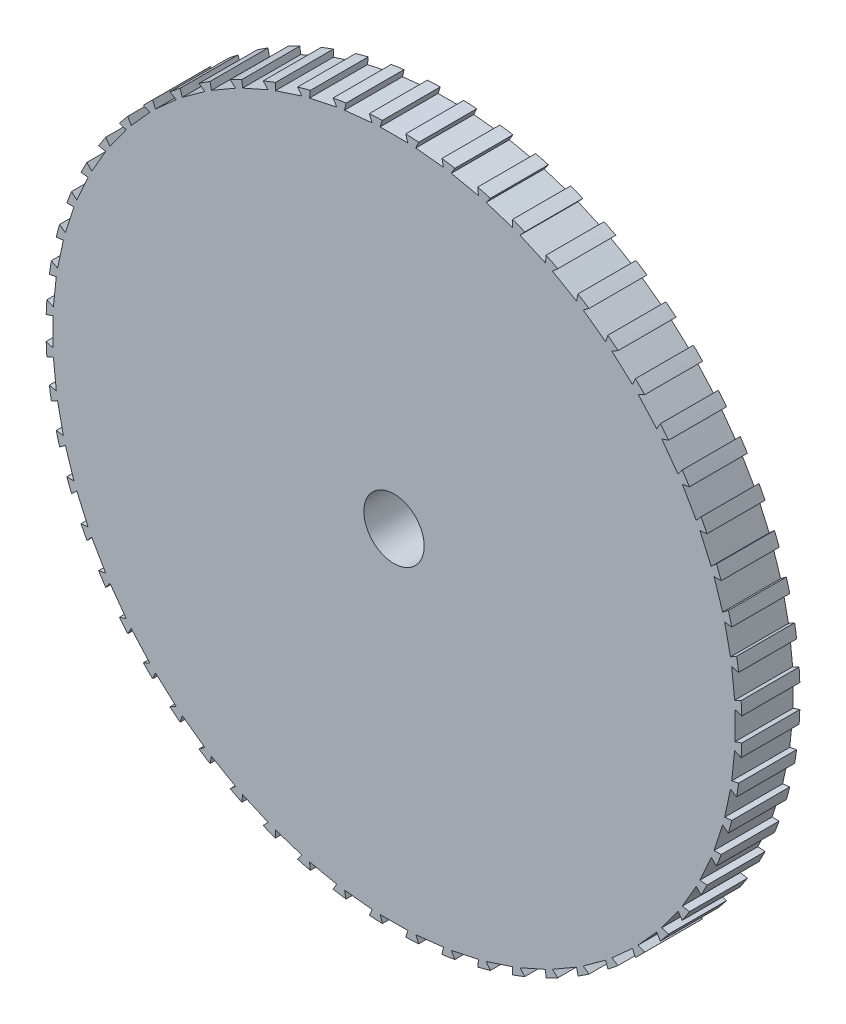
from build123d import *

# Parameters (mm, degrees)
SKETCH1_R           = 19.05
BOSS_EXTRUDE1_DEPTH = 3.175
SKETCH3_2_R         = 1.651
CUT_EXTRUDE2_DEPTH  = 3.175
SKETCH3_3_R         = 1.651
BOSS_EXTRUDE5_DEPTH = 3.175
SKETCH7_R           = 1.651
CUT_EXTRUDE3_DEPTH  = 3.175
SKETCH3_R           = 1.651
CUT_EXTRUDE1_DEPTH  = 3.175


with BuildPart() as part:
    # Sketch1 → Boss-Extrude1 (new body)
    with BuildSketch(Plane.XY):
        Circle(SKETCH1_R)
    extrude(amount=BOSS_EXTRUDE1_DEPTH)

    # Sketch3_2 → Cut-Extrude2 (cut)
    with BuildSketch(Plane.XY.offset(3.175)):
        Circle(SKETCH3_2_R)
        Polygon((-0.762, 18.669), (0.762, 18.669), (0.381, 19.812), (-0.381, 19.812), align=None)
        Polygon((1.692005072, 19.743293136), (2.449830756, 19.663642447), (2.709267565, 18.487078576), (1.193616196, 18.646379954), align=None)
        Polygon((3.746472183, 19.45827462), (4.491820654, 19.299845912), (4.626851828, 18.10260885), (3.136154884, 18.419466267), align=None)
        Polygon((5.75989216, 18.960067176), (6.484597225, 18.724596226), (6.493743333, 17.519803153), (5.044333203, 17.990745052), align=None)
        Polygon((7.710205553, 18.254129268), (8.406327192, 17.944195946), (8.289488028, 16.745046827), (6.897244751, 17.364913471), align=None)
        Polygon((9.576044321, 17.3481953), (10.235955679, 16.9671953), (9.994411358, 15.786828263), (8.674588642, 16.548828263), align=None)
        Polygon((11.336965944, 16.252190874), (11.953436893, 15.804298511), (11.589833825, 14.655645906), (10.356891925, 15.55143063), align=None)
        Polygon((12.973677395, 14.978124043), (13.539953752, 14.468246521), (13.058275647, 13.363893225), (11.925722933, 14.383648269), align=None)
        Polygon((14.468246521, 13.539953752), (14.978124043, 12.973677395), (14.383648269, 11.925722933), (13.363893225, 13.058275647), align=None)
        Polygon((15.804298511, 11.953436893), (16.252190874, 11.336965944), (15.55143063, 10.356891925), (14.655645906, 11.589833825), align=None)
        Polygon((16.9671953, 10.235955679), (17.3481953, 9.576044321), (16.548828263, 8.674588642), (15.786828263, 9.994411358), align=None)
        Polygon((17.944195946, 8.406327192), (18.254129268, 7.710205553), (17.364913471, 6.897244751), (16.745046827, 8.289488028), align=None)
        Polygon((18.724596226, 6.484597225), (18.960067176, 5.75989216), (17.990745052, 5.044333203), (17.519803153, 6.493743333), align=None)
        Polygon((19.299845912, 4.491820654), (19.45827462, 3.746472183), (18.419466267, 3.136154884), (18.10260885, 4.626851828), align=None)
        Polygon((19.663642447, 2.449830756), (19.743293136, 1.692005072), (18.646379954, 1.193616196), (18.487078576, 2.709267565), align=None)
        Polygon((19.812, 0.381), (19.812, -0.381), (18.669, -0.762), (18.669, 0.762), align=None)
        Polygon((19.743293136, -1.692005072), (19.663642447, -2.449830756), (18.487078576, -2.709267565), (18.646379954, -1.193616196), align=None)
        Polygon((19.45827462, -3.746472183), (19.299845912, -4.491820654), (18.10260885, -4.626851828), (18.419466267, -3.136154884), align=None)
        Polygon((18.960067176, -5.75989216), (18.724596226, -6.484597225), (17.519803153, -6.493743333), (17.990745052, -5.044333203), align=None)
        Polygon((18.254129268, -7.710205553), (17.944195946, -8.406327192), (16.745046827, -8.289488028), (17.364913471, -6.897244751), align=None)
        Polygon((17.3481953, -9.576044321), (16.9671953, -10.235955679), (15.786828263, -9.994411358), (16.548828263, -8.674588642), align=None)
        Polygon((16.252190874, -11.336965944), (15.804298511, -11.953436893), (14.655645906, -11.589833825), (15.55143063, -10.356891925), align=None)
        Polygon((14.978124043, -12.973677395), (14.468246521, -13.539953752), (13.363893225, -13.058275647), (14.383648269, -11.925722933), align=None)
        Polygon((13.539953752, -14.468246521), (12.973677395, -14.978124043), (11.925722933, -14.383648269), (13.058275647, -13.363893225), align=None)
        Polygon((11.953436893, -15.804298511), (11.336965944, -16.252190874), (10.356891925, -15.55143063), (11.589833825, -14.655645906), align=None)
        Polygon((10.235955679, -16.9671953), (9.576044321, -17.3481953), (8.674588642, -16.548828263), (9.994411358, -15.786828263), align=None)
        Polygon((8.406327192, -17.944195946), (7.710205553, -18.254129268), (6.897244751, -17.364913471), (8.289488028, -16.745046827), align=None)
        Polygon((6.484597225, -18.724596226), (5.75989216, -18.960067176), (5.044333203, -17.990745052), (6.493743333, -17.519803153), align=None)
        Polygon((4.491820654, -19.299845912), (3.746472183, -19.45827462), (3.136154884, -18.419466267), (4.626851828, -18.10260885), align=None)
        Polygon((2.449830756, -19.663642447), (1.692005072, -19.743293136), (1.193616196, -18.646379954), (2.709267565, -18.487078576), align=None)
        Polygon((0.381, -19.812), (-0.381, -19.812), (-0.762, -18.669), (0.762, -18.669), align=None)
        Polygon((-1.692005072, -19.743293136), (-2.449830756, -19.663642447), (-2.709267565, -18.487078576), (-1.193616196, -18.646379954), align=None)
        Polygon((-3.746472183, -19.45827462), (-4.491820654, -19.299845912), (-4.626851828, -18.10260885), (-3.136154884, -18.419466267), align=None)
        Polygon((-5.75989216, -18.960067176), (-6.484597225, -18.724596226), (-6.493743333, -17.519803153), (-5.044333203, -17.990745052), align=None)
        Polygon((-7.710205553, -18.254129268), (-8.406327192, -17.944195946), (-8.289488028, -16.745046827), (-6.897244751, -17.364913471), align=None)
        Polygon((-9.576044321, -17.3481953), (-10.235955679, -16.9671953), (-9.994411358, -15.786828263), (-8.674588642, -16.548828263), align=None)
        Polygon((-11.336965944, -16.252190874), (-11.953436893, -15.804298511), (-11.589833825, -14.655645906), (-10.356891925, -15.55143063), align=None)
        Polygon((-12.973677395, -14.978124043), (-13.539953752, -14.468246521), (-13.058275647, -13.363893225), (-11.925722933, -14.383648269), align=None)
        Polygon((-14.468246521, -13.539953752), (-14.978124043, -12.973677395), (-14.383648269, -11.925722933), (-13.363893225, -13.058275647), align=None)
        Polygon((-15.804298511, -11.953436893), (-16.252190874, -11.336965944), (-15.55143063, -10.356891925), (-14.655645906, -11.589833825), align=None)
        Polygon((-16.9671953, -10.235955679), (-17.3481953, -9.576044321), (-16.548828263, -8.674588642), (-15.786828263, -9.994411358), align=None)
        Polygon((-17.944195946, -8.406327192), (-18.254129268, -7.710205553), (-17.364913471, -6.897244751), (-16.745046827, -8.289488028), align=None)
        Polygon((-18.724596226, -6.484597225), (-18.960067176, -5.75989216), (-17.990745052, -5.044333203), (-17.519803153, -6.493743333), align=None)
        Polygon((-19.299845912, -4.491820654), (-19.45827462, -3.746472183), (-18.419466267, -3.136154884), (-18.10260885, -4.626851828), align=None)
        Polygon((-19.663642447, -2.449830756), (-19.743293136, -1.692005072), (-18.646379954, -1.193616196), (-18.487078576, -2.709267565), align=None)
        Polygon((-19.812, -0.381), (-19.812, 0.381), (-18.669, 0.762), (-18.669, -0.762), align=None)
        Polygon((-19.743293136, 1.692005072), (-19.663642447, 2.449830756), (-18.487078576, 2.709267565), (-18.646379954, 1.193616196), align=None)
        Polygon((-19.45827462, 3.746472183), (-19.299845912, 4.491820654), (-18.10260885, 4.626851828), (-18.419466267, 3.136154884), align=None)
        Polygon((-18.960067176, 5.75989216), (-18.724596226, 6.484597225), (-17.519803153, 6.493743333), (-17.990745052, 5.044333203), align=None)
        Polygon((-18.254129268, 7.710205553), (-17.944195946, 8.406327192), (-16.745046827, 8.289488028), (-17.364913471, 6.897244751), align=None)
        Polygon((-17.3481953, 9.576044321), (-16.9671953, 10.235955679), (-15.786828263, 9.994411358), (-16.548828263, 8.674588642), align=None)
        Polygon((-16.252190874, 11.336965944), (-15.804298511, 11.953436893), (-14.655645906, 11.589833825), (-15.55143063, 10.356891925), align=None)
        Polygon((-14.978124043, 12.973677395), (-14.468246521, 13.539953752), (-13.363893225, 13.058275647), (-14.383648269, 11.925722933), align=None)
        Polygon((-13.539953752, 14.468246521), (-12.973677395, 14.978124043), (-11.925722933, 14.383648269), (-13.058275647, 13.363893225), align=None)
        Polygon((-11.953436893, 15.804298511), (-11.336965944, 16.252190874), (-10.356891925, 15.55143063), (-11.589833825, 14.655645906), align=None)
        Polygon((-10.235955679, 16.9671953), (-9.576044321, 17.3481953), (-8.674588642, 16.548828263), (-9.994411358, 15.786828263), align=None)
        Polygon((-8.406327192, 17.944195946), (-7.710205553, 18.254129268), (-6.897244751, 17.364913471), (-8.289488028, 16.745046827), align=None)
        Polygon((-6.484597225, 18.724596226), (-5.75989216, 18.960067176), (-5.044333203, 17.990745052), (-6.493743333, 17.519803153), align=None)
        Polygon((-4.491820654, 19.299845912), (-3.746472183, 19.45827462), (-3.136154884, 18.419466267), (-4.626851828, 18.10260885), align=None)
        Polygon((-2.449830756, 19.663642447), (-1.692005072, 19.743293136), (-1.193616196, 18.646379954), (-2.709267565, 18.487078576), align=None)
    extrude(amount=-CUT_EXTRUDE2_DEPTH, mode=Mode.SUBTRACT)

    # Sketch3_3 → Boss-Extrude5 (add)
    with BuildSketch(Plane.XY.offset(3.175)):
        Circle(SKETCH3_3_R)
        Polygon((-0.762, 18.669), (0.762, 18.669), (0.381, 19.812), (-0.381, 19.812), align=None)
        Polygon((1.692005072, 19.743293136), (2.449830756, 19.663642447), (2.709267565, 18.487078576), (1.193616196, 18.646379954), align=None)
        Polygon((3.746472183, 19.45827462), (4.491820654, 19.299845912), (4.626851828, 18.10260885), (3.136154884, 18.419466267), align=None)
        Polygon((5.75989216, 18.960067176), (6.484597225, 18.724596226), (6.493743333, 17.519803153), (5.044333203, 17.990745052), align=None)
        Polygon((7.710205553, 18.254129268), (8.406327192, 17.944195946), (8.289488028, 16.745046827), (6.897244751, 17.364913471), align=None)
        Polygon((9.576044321, 17.3481953), (10.235955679, 16.9671953), (9.994411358, 15.786828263), (8.674588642, 16.548828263), align=None)
        Polygon((11.336965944, 16.252190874), (11.953436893, 15.804298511), (11.589833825, 14.655645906), (10.356891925, 15.55143063), align=None)
        Polygon((12.973677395, 14.978124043), (13.539953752, 14.468246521), (13.058275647, 13.363893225), (11.925722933, 14.383648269), align=None)
        Polygon((14.468246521, 13.539953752), (14.978124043, 12.973677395), (14.383648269, 11.925722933), (13.363893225, 13.058275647), align=None)
        Polygon((15.804298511, 11.953436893), (16.252190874, 11.336965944), (15.55143063, 10.356891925), (14.655645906, 11.589833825), align=None)
        Polygon((16.9671953, 10.235955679), (17.3481953, 9.576044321), (16.548828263, 8.674588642), (15.786828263, 9.994411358), align=None)
        Polygon((17.944195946, 8.406327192), (18.254129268, 7.710205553), (17.364913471, 6.897244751), (16.745046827, 8.289488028), align=None)
        Polygon((18.724596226, 6.484597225), (18.960067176, 5.75989216), (17.990745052, 5.044333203), (17.519803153, 6.493743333), align=None)
        Polygon((19.299845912, 4.491820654), (19.45827462, 3.746472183), (18.419466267, 3.136154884), (18.10260885, 4.626851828), align=None)
        Polygon((19.663642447, 2.449830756), (19.743293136, 1.692005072), (18.646379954, 1.193616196), (18.487078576, 2.709267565), align=None)
        Polygon((19.812, 0.381), (19.812, -0.381), (18.669, -0.762), (18.669, 0.762), align=None)
        Polygon((19.743293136, -1.692005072), (19.663642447, -2.449830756), (18.487078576, -2.709267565), (18.646379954, -1.193616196), align=None)
        Polygon((19.45827462, -3.746472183), (19.299845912, -4.491820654), (18.10260885, -4.626851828), (18.419466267, -3.136154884), align=None)
        Polygon((18.960067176, -5.75989216), (18.724596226, -6.484597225), (17.519803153, -6.493743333), (17.990745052, -5.044333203), align=None)
        Polygon((18.254129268, -7.710205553), (17.944195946, -8.406327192), (16.745046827, -8.289488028), (17.364913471, -6.897244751), align=None)
        Polygon((17.3481953, -9.576044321), (16.9671953, -10.235955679), (15.786828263, -9.994411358), (16.548828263, -8.674588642), align=None)
        Polygon((16.252190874, -11.336965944), (15.804298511, -11.953436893), (14.655645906, -11.589833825), (15.55143063, -10.356891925), align=None)
        Polygon((14.978124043, -12.973677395), (14.468246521, -13.539953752), (13.363893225, -13.058275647), (14.383648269, -11.925722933), align=None)
        Polygon((13.539953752, -14.468246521), (12.973677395, -14.978124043), (11.925722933, -14.383648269), (13.058275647, -13.363893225), align=None)
        Polygon((11.953436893, -15.804298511), (11.336965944, -16.252190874), (10.356891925, -15.55143063), (11.589833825, -14.655645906), align=None)
        Polygon((10.235955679, -16.9671953), (9.576044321, -17.3481953), (8.674588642, -16.548828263), (9.994411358, -15.786828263), align=None)
        Polygon((8.406327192, -17.944195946), (7.710205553, -18.254129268), (6.897244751, -17.364913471), (8.289488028, -16.745046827), align=None)
        Polygon((6.484597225, -18.724596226), (5.75989216, -18.960067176), (5.044333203, -17.990745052), (6.493743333, -17.519803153), align=None)
        Polygon((4.491820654, -19.299845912), (3.746472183, -19.45827462), (3.136154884, -18.419466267), (4.626851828, -18.10260885), align=None)
        Polygon((2.449830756, -19.663642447), (1.692005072, -19.743293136), (1.193616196, -18.646379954), (2.709267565, -18.487078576), align=None)
        Polygon((0.381, -19.812), (-0.381, -19.812), (-0.762, -18.669), (0.762, -18.669), align=None)
        Polygon((-1.692005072, -19.743293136), (-2.449830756, -19.663642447), (-2.709267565, -18.487078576), (-1.193616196, -18.646379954), align=None)
        Polygon((-3.746472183, -19.45827462), (-4.491820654, -19.299845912), (-4.626851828, -18.10260885), (-3.136154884, -18.419466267), align=None)
        Polygon((-5.75989216, -18.960067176), (-6.484597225, -18.724596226), (-6.493743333, -17.519803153), (-5.044333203, -17.990745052), align=None)
        Polygon((-7.710205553, -18.254129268), (-8.406327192, -17.944195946), (-8.289488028, -16.745046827), (-6.897244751, -17.364913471), align=None)
        Polygon((-9.576044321, -17.3481953), (-10.235955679, -16.9671953), (-9.994411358, -15.786828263), (-8.674588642, -16.548828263), align=None)
        Polygon((-11.336965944, -16.252190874), (-11.953436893, -15.804298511), (-11.589833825, -14.655645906), (-10.356891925, -15.55143063), align=None)
        Polygon((-12.973677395, -14.978124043), (-13.539953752, -14.468246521), (-13.058275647, -13.363893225), (-11.925722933, -14.383648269), align=None)
        Polygon((-14.468246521, -13.539953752), (-14.978124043, -12.973677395), (-14.383648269, -11.925722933), (-13.363893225, -13.058275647), align=None)
        Polygon((-15.804298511, -11.953436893), (-16.252190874, -11.336965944), (-15.55143063, -10.356891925), (-14.655645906, -11.589833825), align=None)
        Polygon((-16.9671953, -10.235955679), (-17.3481953, -9.576044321), (-16.548828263, -8.674588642), (-15.786828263, -9.994411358), align=None)
        Polygon((-17.944195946, -8.406327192), (-18.254129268, -7.710205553), (-17.364913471, -6.897244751), (-16.745046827, -8.289488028), align=None)
        Polygon((-18.724596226, -6.484597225), (-18.960067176, -5.75989216), (-17.990745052, -5.044333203), (-17.519803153, -6.493743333), align=None)
        Polygon((-19.299845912, -4.491820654), (-19.45827462, -3.746472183), (-18.419466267, -3.136154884), (-18.10260885, -4.626851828), align=None)
        Polygon((-19.663642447, -2.449830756), (-19.743293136, -1.692005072), (-18.646379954, -1.193616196), (-18.487078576, -2.709267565), align=None)
        Polygon((-19.812, -0.381), (-19.812, 0.381), (-18.669, 0.762), (-18.669, -0.762), align=None)
        Polygon((-19.743293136, 1.692005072), (-19.663642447, 2.449830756), (-18.487078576, 2.709267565), (-18.646379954, 1.193616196), align=None)
        Polygon((-19.45827462, 3.746472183), (-19.299845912, 4.491820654), (-18.10260885, 4.626851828), (-18.419466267, 3.136154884), align=None)
        Polygon((-18.960067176, 5.75989216), (-18.724596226, 6.484597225), (-17.519803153, 6.493743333), (-17.990745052, 5.044333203), align=None)
        Polygon((-18.254129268, 7.710205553), (-17.944195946, 8.406327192), (-16.745046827, 8.289488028), (-17.364913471, 6.897244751), align=None)
        Polygon((-17.3481953, 9.576044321), (-16.9671953, 10.235955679), (-15.786828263, 9.994411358), (-16.548828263, 8.674588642), align=None)
        Polygon((-16.252190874, 11.336965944), (-15.804298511, 11.953436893), (-14.655645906, 11.589833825), (-15.55143063, 10.356891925), align=None)
        Polygon((-14.978124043, 12.973677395), (-14.468246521, 13.539953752), (-13.363893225, 13.058275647), (-14.383648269, 11.925722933), align=None)
        Polygon((-13.539953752, 14.468246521), (-12.973677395, 14.978124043), (-11.925722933, 14.383648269), (-13.058275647, 13.363893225), align=None)
        Polygon((-11.953436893, 15.804298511), (-11.336965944, 16.252190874), (-10.356891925, 15.55143063), (-11.589833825, 14.655645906), align=None)
        Polygon((-10.235955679, 16.9671953), (-9.576044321, 17.3481953), (-8.674588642, 16.548828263), (-9.994411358, 15.786828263), align=None)
        Polygon((-8.406327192, 17.944195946), (-7.710205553, 18.254129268), (-6.897244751, 17.364913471), (-8.289488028, 16.745046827), align=None)
        Polygon((-6.484597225, 18.724596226), (-5.75989216, 18.960067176), (-5.044333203, 17.990745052), (-6.493743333, 17.519803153), align=None)
        Polygon((-4.491820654, 19.299845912), (-3.746472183, 19.45827462), (-3.136154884, 18.419466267), (-4.626851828, 18.10260885), align=None)
        Polygon((-2.449830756, 19.663642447), (-1.692005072, 19.743293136), (-1.193616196, 18.646379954), (-2.709267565, 18.487078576), align=None)
    extrude(amount=-BOSS_EXTRUDE5_DEPTH)

    # Sketch7 → Cut-Extrude3 (cut)
    with BuildSketch(Plane.XY.offset(3.175)):
        Circle(SKETCH7_R)
    extrude(amount=-CUT_EXTRUDE3_DEPTH, mode=Mode.SUBTRACT)

    # Sketch3 → Cut-Extrude1 (cut)
    with BuildSketch(Plane.XY.offset(3.175)):
        Circle(SKETCH3_R)
        Polygon((-0.762, 18.669), (0.762, 18.669), (0.381, 19.812), (-0.381, 19.812), align=None)
        Polygon((1.692005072, 19.743293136), (2.449830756, 19.663642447), (2.709267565, 18.487078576), (1.193616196, 18.646379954), align=None)
        Polygon((3.746472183, 19.45827462), (4.491820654, 19.299845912), (4.626851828, 18.10260885), (3.136154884, 18.419466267), align=None)
        Polygon((5.75989216, 18.960067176), (6.484597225, 18.724596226), (6.493743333, 17.519803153), (5.044333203, 17.990745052), align=None)
        Polygon((7.710205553, 18.254129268), (8.406327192, 17.944195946), (8.289488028, 16.745046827), (6.897244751, 17.364913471), align=None)
        Polygon((9.576044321, 17.3481953), (10.235955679, 16.9671953), (9.994411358, 15.786828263), (8.674588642, 16.548828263), align=None)
        Polygon((11.336965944, 16.252190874), (11.953436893, 15.804298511), (11.589833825, 14.655645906), (10.356891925, 15.55143063), align=None)
        Polygon((12.973677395, 14.978124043), (13.539953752, 14.468246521), (13.058275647, 13.363893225), (11.925722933, 14.383648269), align=None)
        Polygon((14.468246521, 13.539953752), (14.978124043, 12.973677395), (14.383648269, 11.925722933), (13.363893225, 13.058275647), align=None)
        Polygon((15.804298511, 11.953436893), (16.252190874, 11.336965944), (15.55143063, 10.356891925), (14.655645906, 11.589833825), align=None)
        Polygon((16.9671953, 10.235955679), (17.3481953, 9.576044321), (16.548828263, 8.674588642), (15.786828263, 9.994411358), align=None)
        Polygon((17.944195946, 8.406327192), (18.254129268, 7.710205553), (17.364913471, 6.897244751), (16.745046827, 8.289488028), align=None)
        Polygon((18.724596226, 6.484597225), (18.960067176, 5.75989216), (17.990745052, 5.044333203), (17.519803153, 6.493743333), align=None)
        Polygon((19.299845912, 4.491820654), (19.45827462, 3.746472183), (18.419466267, 3.136154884), (18.10260885, 4.626851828), align=None)
        Polygon((19.663642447, 2.449830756), (19.743293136, 1.692005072), (18.646379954, 1.193616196), (18.487078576, 2.709267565), align=None)
        Polygon((19.812, 0.381), (19.812, -0.381), (18.669, -0.762), (18.669, 0.762), align=None)
        Polygon((19.743293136, -1.692005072), (19.663642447, -2.449830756), (18.487078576, -2.709267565), (18.646379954, -1.193616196), align=None)
        Polygon((19.45827462, -3.746472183), (19.299845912, -4.491820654), (18.10260885, -4.626851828), (18.419466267, -3.136154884), align=None)
        Polygon((18.960067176, -5.75989216), (18.724596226, -6.484597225), (17.519803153, -6.493743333), (17.990745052, -5.044333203), align=None)
        Polygon((18.254129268, -7.710205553), (17.944195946, -8.406327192), (16.745046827, -8.289488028), (17.364913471, -6.897244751), align=None)
        Polygon((17.3481953, -9.576044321), (16.9671953, -10.235955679), (15.786828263, -9.994411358), (16.548828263, -8.674588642), align=None)
        Polygon((16.252190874, -11.336965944), (15.804298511, -11.953436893), (14.655645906, -11.589833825), (15.55143063, -10.356891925), align=None)
        Polygon((14.978124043, -12.973677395), (14.468246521, -13.539953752), (13.363893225, -13.058275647), (14.383648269, -11.925722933), align=None)
        Polygon((13.539953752, -14.468246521), (12.973677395, -14.978124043), (11.925722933, -14.383648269), (13.058275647, -13.363893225), align=None)
        Polygon((11.953436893, -15.804298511), (11.336965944, -16.252190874), (10.356891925, -15.55143063), (11.589833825, -14.655645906), align=None)
        Polygon((10.235955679, -16.9671953), (9.576044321, -17.3481953), (8.674588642, -16.548828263), (9.994411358, -15.786828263), align=None)
        Polygon((8.406327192, -17.944195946), (7.710205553, -18.254129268), (6.897244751, -17.364913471), (8.289488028, -16.745046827), align=None)
        Polygon((6.484597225, -18.724596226), (5.75989216, -18.960067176), (5.044333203, -17.990745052), (6.493743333, -17.519803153), align=None)
        Polygon((4.491820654, -19.299845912), (3.746472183, -19.45827462), (3.136154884, -18.419466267), (4.626851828, -18.10260885), align=None)
        Polygon((2.449830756, -19.663642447), (1.692005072, -19.743293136), (1.193616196, -18.646379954), (2.709267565, -18.487078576), align=None)
        Polygon((0.381, -19.812), (-0.381, -19.812), (-0.762, -18.669), (0.762, -18.669), align=None)
        Polygon((-1.692005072, -19.743293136), (-2.449830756, -19.663642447), (-2.709267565, -18.487078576), (-1.193616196, -18.646379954), align=None)
        Polygon((-3.746472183, -19.45827462), (-4.491820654, -19.299845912), (-4.626851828, -18.10260885), (-3.136154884, -18.419466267), align=None)
        Polygon((-5.75989216, -18.960067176), (-6.484597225, -18.724596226), (-6.493743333, -17.519803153), (-5.044333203, -17.990745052), align=None)
        Polygon((-7.710205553, -18.254129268), (-8.406327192, -17.944195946), (-8.289488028, -16.745046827), (-6.897244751, -17.364913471), align=None)
        Polygon((-9.576044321, -17.3481953), (-10.235955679, -16.9671953), (-9.994411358, -15.786828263), (-8.674588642, -16.548828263), align=None)
        Polygon((-11.336965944, -16.252190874), (-11.953436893, -15.804298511), (-11.589833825, -14.655645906), (-10.356891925, -15.55143063), align=None)
        Polygon((-12.973677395, -14.978124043), (-13.539953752, -14.468246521), (-13.058275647, -13.363893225), (-11.925722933, -14.383648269), align=None)
        Polygon((-14.468246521, -13.539953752), (-14.978124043, -12.973677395), (-14.383648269, -11.925722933), (-13.363893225, -13.058275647), align=None)
        Polygon((-15.804298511, -11.953436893), (-16.252190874, -11.336965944), (-15.55143063, -10.356891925), (-14.655645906, -11.589833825), align=None)
        Polygon((-16.9671953, -10.235955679), (-17.3481953, -9.576044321), (-16.548828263, -8.674588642), (-15.786828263, -9.994411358), align=None)
        Polygon((-17.944195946, -8.406327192), (-18.254129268, -7.710205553), (-17.364913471, -6.897244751), (-16.745046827, -8.289488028), align=None)
        Polygon((-18.724596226, -6.484597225), (-18.960067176, -5.75989216), (-17.990745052, -5.044333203), (-17.519803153, -6.493743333), align=None)
        Polygon((-19.299845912, -4.491820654), (-19.45827462, -3.746472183), (-18.419466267, -3.136154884), (-18.10260885, -4.626851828), align=None)
        Polygon((-19.663642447, -2.449830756), (-19.743293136, -1.692005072), (-18.646379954, -1.193616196), (-18.487078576, -2.709267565), align=None)
        Polygon((-19.812, -0.381), (-19.812, 0.381), (-18.669, 0.762), (-18.669, -0.762), align=None)
        Polygon((-19.743293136, 1.692005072), (-19.663642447, 2.449830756), (-18.487078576, 2.709267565), (-18.646379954, 1.193616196), align=None)
        Polygon((-19.45827462, 3.746472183), (-19.299845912, 4.491820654), (-18.10260885, 4.626851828), (-18.419466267, 3.136154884), align=None)
        Polygon((-18.960067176, 5.75989216), (-18.724596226, 6.484597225), (-17.519803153, 6.493743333), (-17.990745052, 5.044333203), align=None)
        Polygon((-18.254129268, 7.710205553), (-17.944195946, 8.406327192), (-16.745046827, 8.289488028), (-17.364913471, 6.897244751), align=None)
        Polygon((-17.3481953, 9.576044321), (-16.9671953, 10.235955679), (-15.786828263, 9.994411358), (-16.548828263, 8.674588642), align=None)
        Polygon((-16.252190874, 11.336965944), (-15.804298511, 11.953436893), (-14.655645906, 11.589833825), (-15.55143063, 10.356891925), align=None)
        Polygon((-14.978124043, 12.973677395), (-14.468246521, 13.539953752), (-13.363893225, 13.058275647), (-14.383648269, 11.925722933), align=None)
        Polygon((-13.539953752, 14.468246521), (-12.973677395, 14.978124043), (-11.925722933, 14.383648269), (-13.058275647, 13.363893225), align=None)
        Polygon((-11.953436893, 15.804298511), (-11.336965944, 16.252190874), (-10.356891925, 15.55143063), (-11.589833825, 14.655645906), align=None)
        Polygon((-10.235955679, 16.9671953), (-9.576044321, 17.3481953), (-8.674588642, 16.548828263), (-9.994411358, 15.786828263), align=None)
        Polygon((-8.406327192, 17.944195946), (-7.710205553, 18.254129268), (-6.897244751, 17.364913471), (-8.289488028, 16.745046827), align=None)
        Polygon((-6.484597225, 18.724596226), (-5.75989216, 18.960067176), (-5.044333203, 17.990745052), (-6.493743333, 17.519803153), align=None)
        Polygon((-4.491820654, 19.299845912), (-3.746472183, 19.45827462), (-3.136154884, 18.419466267), (-4.626851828, 18.10260885), align=None)
        Polygon((-2.449830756, 19.663642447), (-1.692005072, 19.743293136), (-1.193616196, 18.646379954), (-2.709267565, 18.487078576), align=None)
    extrude(amount=-CUT_EXTRUDE1_DEPTH, mode=Mode.SUBTRACT)


solid = part.part
